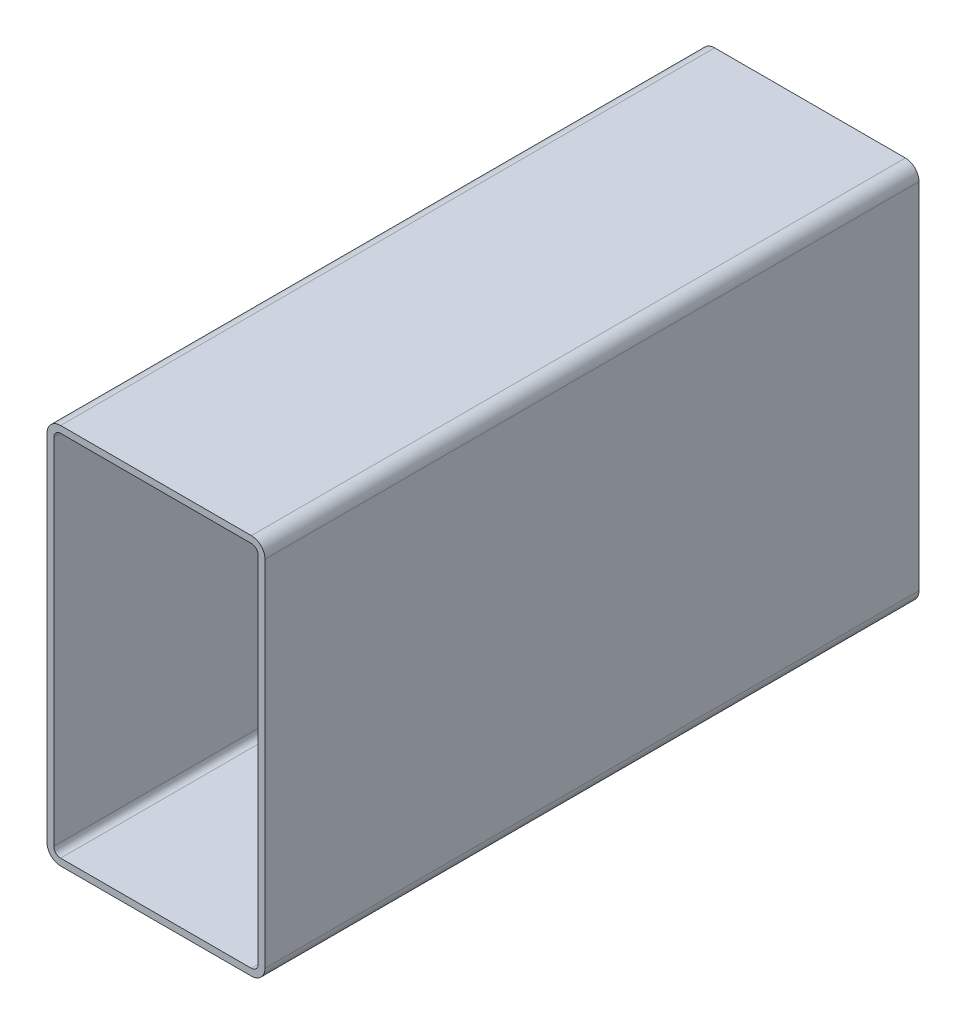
ISO-10303-21;
HEADER;
FILE_DESCRIPTION(('STEP AP214'),'2;1');
FILE_NAME('part.step','',(''),(''),'','','');
FILE_SCHEMA(('AUTOMOTIVE_DESIGN { 1 0 10303 214 1 1 1 1 }'));
ENDSEC;
DATA;
#1=APPLICATION_CONTEXT('core data for automotive mechanical design processes');
#2=APPLICATION_PROTOCOL_DEFINITION('international standard','automotive_design',2000,#1);
#3=PRODUCT_CONTEXT('',#1,'mechanical');
#4=PRODUCT('Part','Part','',(#3));
#5=PRODUCT_RELATED_PRODUCT_CATEGORY('part','',(#4));
#6=PRODUCT_DEFINITION_FORMATION('','',#4);
#7=PRODUCT_DEFINITION_CONTEXT('part definition',#1,'design');
#8=PRODUCT_DEFINITION('design','',#6,#7);
#9=PRODUCT_DEFINITION_SHAPE('','',#8);
#10=(LENGTH_UNIT() NAMED_UNIT(*) SI_UNIT(.MILLI.,.METRE.));
#11=(NAMED_UNIT(*) PLANE_ANGLE_UNIT() SI_UNIT($,.RADIAN.));
#12=(NAMED_UNIT(*) SI_UNIT($,.STERADIAN.) SOLID_ANGLE_UNIT());
#13=UNCERTAINTY_MEASURE_WITH_UNIT(LENGTH_MEASURE(1.E-05),#10,'distance_accuracy_value','');
#14=(GEOMETRIC_REPRESENTATION_CONTEXT(3) GLOBAL_UNCERTAINTY_ASSIGNED_CONTEXT((#13)) GLOBAL_UNIT_ASSIGNED_CONTEXT((#10,
#11,#12)) REPRESENTATION_CONTEXT('',''));
#15=CARTESIAN_POINT('',(0.,0.,0.));
#16=DIRECTION('',(0.,0.,1.));
#17=DIRECTION('',(1.,0.,0.));
#18=AXIS2_PLACEMENT_3D('',#15,#16,#17);
#19=CARTESIAN_POINT('',(8.02517782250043,173.439039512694,304.8));
#20=DIRECTION('',(0.,0.,1.));
#21=DIRECTION('',(1.,0.,0.));
#22=AXIS2_PLACEMENT_3D('',#19,#20,#21);
#23=PLANE('',#22);
#24=CARTESIAN_POINT('',(8.02517782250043,173.439039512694,304.8));
#25=DIRECTION('',(0.,0.,1.));
#26=DIRECTION('',(1.,0.,0.));
#27=AXIS2_PLACEMENT_3D('',#24,#25,#26);
#28=CIRCLE('',#27,6.35);
#29=CARTESIAN_POINT('',(8.02517782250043,179.789039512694,304.8));
#30=VERTEX_POINT('',#29);
#31=CARTESIAN_POINT('',(1.67517782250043,173.439039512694,304.8));
#32=VERTEX_POINT('',#31);
#33=EDGE_CURVE('E211',#30,#32,#28,.T.);
#34=ORIENTED_EDGE('',*,*,#33,.T.);
#35=DIRECTION('',(0.,-1.,0.));
#36=VECTOR('',#35,1.);
#37=CARTESIAN_POINT('',(1.67517782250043,8.33903951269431,304.8));
#38=LINE('',#37,#36);
#39=CARTESIAN_POINT('',(1.67517782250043,8.33903951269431,304.8));
#40=VERTEX_POINT('',#39);
#41=EDGE_CURVE('E214',#32,#40,#38,.T.);
#42=ORIENTED_EDGE('',*,*,#41,.T.);
#43=CARTESIAN_POINT('',(8.02517782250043,8.33903951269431,304.8));
#44=DIRECTION('',(0.,0.,1.));
#45=DIRECTION('',(1.,0.,0.));
#46=AXIS2_PLACEMENT_3D('',#43,#44,#45);
#47=CIRCLE('',#46,6.35);
#48=CARTESIAN_POINT('',(8.02517782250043,1.98903951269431,304.8));
#49=VERTEX_POINT('',#48);
#50=EDGE_CURVE('E217',#40,#49,#47,.T.);
#51=ORIENTED_EDGE('',*,*,#50,.T.);
#52=DIRECTION('',(1.,0.,0.));
#53=VECTOR('',#52,1.);
#54=CARTESIAN_POINT('',(96.9251778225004,1.98903951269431,304.8));
#55=LINE('',#54,#53);
#56=CARTESIAN_POINT('',(96.9251778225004,1.98903951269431,304.8));
#57=VERTEX_POINT('',#56);
#58=EDGE_CURVE('E219',#49,#57,#55,.T.);
#59=ORIENTED_EDGE('',*,*,#58,.T.);
#60=CARTESIAN_POINT('',(96.9251778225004,8.33903951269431,304.8));
#61=DIRECTION('',(0.,0.,1.));
#62=DIRECTION('',(1.,0.,0.));
#63=AXIS2_PLACEMENT_3D('',#60,#61,#62);
#64=CIRCLE('',#63,6.35);
#65=CARTESIAN_POINT('',(103.2751778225,8.33903951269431,304.8));
#66=VERTEX_POINT('',#65);
#67=EDGE_CURVE('E221',#57,#66,#64,.T.);
#68=ORIENTED_EDGE('',*,*,#67,.T.);
#69=DIRECTION('',(0.,1.,0.));
#70=VECTOR('',#69,1.);
#71=CARTESIAN_POINT('',(103.2751778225,173.439039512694,304.8));
#72=LINE('',#71,#70);
#73=CARTESIAN_POINT('',(103.2751778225,173.439039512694,304.8));
#74=VERTEX_POINT('',#73);
#75=EDGE_CURVE('E223',#66,#74,#72,.T.);
#76=ORIENTED_EDGE('',*,*,#75,.T.);
#77=CARTESIAN_POINT('',(96.9251778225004,173.439039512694,304.8));
#78=DIRECTION('',(0.,0.,1.));
#79=DIRECTION('',(1.,0.,0.));
#80=AXIS2_PLACEMENT_3D('',#77,#78,#79);
#81=CIRCLE('',#80,6.34999999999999);
#82=CARTESIAN_POINT('',(96.9251778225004,179.789039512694,304.8));
#83=VERTEX_POINT('',#82);
#84=EDGE_CURVE('E225',#74,#83,#81,.T.);
#85=ORIENTED_EDGE('',*,*,#84,.T.);
#86=DIRECTION('',(-1.,0.,0.));
#87=VECTOR('',#86,1.);
#88=CARTESIAN_POINT('',(8.02517782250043,179.789039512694,304.8));
#89=LINE('',#88,#87);
#90=EDGE_CURVE('E227',#83,#30,#89,.T.);
#91=ORIENTED_EDGE('',*,*,#90,.T.);
#92=EDGE_LOOP('',(#34,#42,#51,#59,#68,#76,#85,#91));
#93=FACE_BOUND('',#92,.T.);
#94=DIRECTION('',(0.,-1.,0.));
#95=VECTOR('',#94,1.);
#96=CARTESIAN_POINT('',(4.85017782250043,8.33903951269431,304.8));
#97=LINE('',#96,#95);
#98=CARTESIAN_POINT('',(4.85017782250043,173.439039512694,304.8));
#99=VERTEX_POINT('',#98);
#100=CARTESIAN_POINT('',(4.85017782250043,8.33903951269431,304.8));
#101=VERTEX_POINT('',#100);
#102=EDGE_CURVE('E154',#99,#101,#97,.T.);
#103=ORIENTED_EDGE('',*,*,#102,.F.);
#104=CARTESIAN_POINT('',(8.02517782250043,173.439039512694,304.8));
#105=DIRECTION('',(0.,0.,1.));
#106=DIRECTION('',(1.,0.,0.));
#107=AXIS2_PLACEMENT_3D('',#104,#105,#106);
#108=CIRCLE('',#107,3.17500000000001);
#109=CARTESIAN_POINT('',(8.02517782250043,176.614039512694,304.8));
#110=VERTEX_POINT('',#109);
#111=EDGE_CURVE('E146',#110,#99,#108,.T.);
#112=ORIENTED_EDGE('',*,*,#111,.F.);
#113=DIRECTION('',(-1.,0.,0.));
#114=VECTOR('',#113,1.);
#115=CARTESIAN_POINT('',(8.02517782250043,176.614039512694,304.8));
#116=LINE('',#115,#114);
#117=CARTESIAN_POINT('',(96.9251778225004,176.614039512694,304.8));
#118=VERTEX_POINT('',#117);
#119=EDGE_CURVE('E179',#118,#110,#116,.T.);
#120=ORIENTED_EDGE('',*,*,#119,.F.);
#121=CARTESIAN_POINT('',(96.9251778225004,173.439039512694,304.8));
#122=DIRECTION('',(0.,0.,1.));
#123=DIRECTION('',(1.,0.,0.));
#124=AXIS2_PLACEMENT_3D('',#121,#122,#123);
#125=CIRCLE('',#124,3.175);
#126=CARTESIAN_POINT('',(100.1001778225,173.439039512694,304.8));
#127=VERTEX_POINT('',#126);
#128=EDGE_CURVE('E177',#127,#118,#125,.T.);
#129=ORIENTED_EDGE('',*,*,#128,.F.);
#130=DIRECTION('',(0.,1.,0.));
#131=VECTOR('',#130,1.);
#132=CARTESIAN_POINT('',(100.1001778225,173.439039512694,304.8));
#133=LINE('',#132,#131);
#134=CARTESIAN_POINT('',(100.1001778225,8.33903951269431,304.8));
#135=VERTEX_POINT('',#134);
#136=EDGE_CURVE('E175',#135,#127,#133,.T.);
#137=ORIENTED_EDGE('',*,*,#136,.F.);
#138=CARTESIAN_POINT('',(96.9251778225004,8.33903951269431,304.8));
#139=DIRECTION('',(0.,0.,1.));
#140=DIRECTION('',(1.,0.,0.));
#141=AXIS2_PLACEMENT_3D('',#138,#139,#140);
#142=CIRCLE('',#141,3.175);
#143=CARTESIAN_POINT('',(96.9251778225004,5.16403951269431,304.8));
#144=VERTEX_POINT('',#143);
#145=EDGE_CURVE('E173',#144,#135,#142,.T.);
#146=ORIENTED_EDGE('',*,*,#145,.F.);
#147=DIRECTION('',(1.,0.,0.));
#148=VECTOR('',#147,1.);
#149=CARTESIAN_POINT('',(96.9251778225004,5.16403951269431,304.8));
#150=LINE('',#149,#148);
#151=CARTESIAN_POINT('',(8.02517782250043,5.16403951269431,304.8));
#152=VERTEX_POINT('',#151);
#153=EDGE_CURVE('E169',#152,#144,#150,.T.);
#154=ORIENTED_EDGE('',*,*,#153,.F.);
#155=CARTESIAN_POINT('',(8.02517782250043,8.33903951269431,304.8));
#156=DIRECTION('',(0.,0.,1.));
#157=DIRECTION('',(1.,0.,0.));
#158=AXIS2_PLACEMENT_3D('',#155,#156,#157);
#159=CIRCLE('',#158,3.175);
#160=EDGE_CURVE('E167',#101,#152,#159,.T.);
#161=ORIENTED_EDGE('',*,*,#160,.F.);
#162=EDGE_LOOP('',(#103,#112,#120,#129,#137,#146,#154,#161));
#163=FACE_BOUND('',#162,.T.);
#164=ADVANCED_FACE('F33',(#93,#163),#23,.T.);
#165=CARTESIAN_POINT('',(8.02517782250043,173.439039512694,0.));
#166=DIRECTION('',(0.,0.,1.));
#167=DIRECTION('',(1.,0.,0.));
#168=AXIS2_PLACEMENT_3D('',#165,#166,#167);
#169=PLANE('',#168);
#170=CARTESIAN_POINT('',(8.02517782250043,173.439039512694,0.));
#171=DIRECTION('',(0.,0.,1.));
#172=DIRECTION('',(1.,0.,0.));
#173=AXIS2_PLACEMENT_3D('',#170,#171,#172);
#174=CIRCLE('',#173,6.35);
#175=CARTESIAN_POINT('',(8.02517782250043,179.789039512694,0.));
#176=VERTEX_POINT('',#175);
#177=CARTESIAN_POINT('',(1.67517782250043,173.439039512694,0.));
#178=VERTEX_POINT('',#177);
#179=EDGE_CURVE('E162',#176,#178,#174,.T.);
#180=ORIENTED_EDGE('',*,*,#179,.F.);
#181=DIRECTION('',(-1.,0.,0.));
#182=VECTOR('',#181,1.);
#183=CARTESIAN_POINT('',(8.02517782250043,179.789039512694,0.));
#184=LINE('',#183,#182);
#185=CARTESIAN_POINT('',(96.9251778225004,179.789039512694,0.));
#186=VERTEX_POINT('',#185);
#187=EDGE_CURVE('E215',#186,#176,#184,.T.);
#188=ORIENTED_EDGE('',*,*,#187,.F.);
#189=CARTESIAN_POINT('',(96.9251778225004,173.439039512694,0.));
#190=DIRECTION('',(0.,0.,1.));
#191=DIRECTION('',(1.,0.,0.));
#192=AXIS2_PLACEMENT_3D('',#189,#190,#191);
#193=CIRCLE('',#192,6.34999999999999);
#194=CARTESIAN_POINT('',(103.2751778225,173.439039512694,0.));
#195=VERTEX_POINT('',#194);
#196=EDGE_CURVE('E242',#195,#186,#193,.T.);
#197=ORIENTED_EDGE('',*,*,#196,.F.);
#198=DIRECTION('',(0.,1.,0.));
#199=VECTOR('',#198,1.);
#200=CARTESIAN_POINT('',(103.2751778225,173.439039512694,0.));
#201=LINE('',#200,#199);
#202=CARTESIAN_POINT('',(103.2751778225,8.33903951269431,0.));
#203=VERTEX_POINT('',#202);
#204=EDGE_CURVE('E240',#203,#195,#201,.T.);
#205=ORIENTED_EDGE('',*,*,#204,.F.);
#206=CARTESIAN_POINT('',(96.9251778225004,8.33903951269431,0.));
#207=DIRECTION('',(0.,0.,1.));
#208=DIRECTION('',(1.,0.,0.));
#209=AXIS2_PLACEMENT_3D('',#206,#207,#208);
#210=CIRCLE('',#209,6.35);
#211=CARTESIAN_POINT('',(96.9251778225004,1.98903951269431,0.));
#212=VERTEX_POINT('',#211);
#213=EDGE_CURVE('E238',#212,#203,#210,.T.);
#214=ORIENTED_EDGE('',*,*,#213,.F.);
#215=DIRECTION('',(1.,0.,0.));
#216=VECTOR('',#215,1.);
#217=CARTESIAN_POINT('',(96.9251778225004,1.98903951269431,0.));
#218=LINE('',#217,#216);
#219=CARTESIAN_POINT('',(8.02517782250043,1.98903951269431,0.));
#220=VERTEX_POINT('',#219);
#221=EDGE_CURVE('E236',#220,#212,#218,.T.);
#222=ORIENTED_EDGE('',*,*,#221,.F.);
#223=CARTESIAN_POINT('',(8.02517782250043,8.33903951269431,0.));
#224=DIRECTION('',(0.,0.,1.));
#225=DIRECTION('',(1.,0.,0.));
#226=AXIS2_PLACEMENT_3D('',#223,#224,#225);
#227=CIRCLE('',#226,6.35);
#228=CARTESIAN_POINT('',(1.67517782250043,8.33903951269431,0.));
#229=VERTEX_POINT('',#228);
#230=EDGE_CURVE('E234',#229,#220,#227,.T.);
#231=ORIENTED_EDGE('',*,*,#230,.F.);
#232=DIRECTION('',(0.,-1.,0.));
#233=VECTOR('',#232,1.);
#234=CARTESIAN_POINT('',(1.67517782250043,8.33903951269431,0.));
#235=LINE('',#234,#233);
#236=EDGE_CURVE('E232',#178,#229,#235,.T.);
#237=ORIENTED_EDGE('',*,*,#236,.F.);
#238=EDGE_LOOP('',(#180,#188,#197,#205,#214,#222,#231,#237));
#239=FACE_BOUND('',#238,.T.);
#240=CARTESIAN_POINT('',(8.02517782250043,173.439039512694,0.));
#241=DIRECTION('',(0.,0.,1.));
#242=DIRECTION('',(1.,0.,0.));
#243=AXIS2_PLACEMENT_3D('',#240,#241,#242);
#244=CIRCLE('',#243,3.17500000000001);
#245=CARTESIAN_POINT('',(8.02517782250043,176.614039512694,0.));
#246=VERTEX_POINT('',#245);
#247=CARTESIAN_POINT('',(4.85017782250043,173.439039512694,0.));
#248=VERTEX_POINT('',#247);
#249=EDGE_CURVE('E56',#246,#248,#244,.T.);
#250=ORIENTED_EDGE('',*,*,#249,.T.);
#251=DIRECTION('',(0.,-1.,0.));
#252=VECTOR('',#251,1.);
#253=CARTESIAN_POINT('',(4.85017782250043,8.33903951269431,0.));
#254=LINE('',#253,#252);
#255=CARTESIAN_POINT('',(4.85017782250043,8.33903951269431,0.));
#256=VERTEX_POINT('',#255);
#257=EDGE_CURVE('E161',#248,#256,#254,.T.);
#258=ORIENTED_EDGE('',*,*,#257,.T.);
#259=CARTESIAN_POINT('',(8.02517782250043,8.33903951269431,0.));
#260=DIRECTION('',(0.,0.,1.));
#261=DIRECTION('',(1.,0.,0.));
#262=AXIS2_PLACEMENT_3D('',#259,#260,#261);
#263=CIRCLE('',#262,3.175);
#264=CARTESIAN_POINT('',(8.02517782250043,5.16403951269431,0.));
#265=VERTEX_POINT('',#264);
#266=EDGE_CURVE('E183',#256,#265,#263,.T.);
#267=ORIENTED_EDGE('',*,*,#266,.T.);
#268=DIRECTION('',(1.,0.,0.));
#269=VECTOR('',#268,1.);
#270=CARTESIAN_POINT('',(96.9251778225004,5.16403951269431,0.));
#271=LINE('',#270,#269);
#272=CARTESIAN_POINT('',(96.9251778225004,5.16403951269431,0.));
#273=VERTEX_POINT('',#272);
#274=EDGE_CURVE('E186',#265,#273,#271,.T.);
#275=ORIENTED_EDGE('',*,*,#274,.T.);
#276=CARTESIAN_POINT('',(96.9251778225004,8.33903951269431,0.));
#277=DIRECTION('',(0.,0.,1.));
#278=DIRECTION('',(1.,0.,0.));
#279=AXIS2_PLACEMENT_3D('',#276,#277,#278);
#280=CIRCLE('',#279,3.175);
#281=CARTESIAN_POINT('',(100.1001778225,8.33903951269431,0.));
#282=VERTEX_POINT('',#281);
#283=EDGE_CURVE('E189',#273,#282,#280,.T.);
#284=ORIENTED_EDGE('',*,*,#283,.T.);
#285=DIRECTION('',(0.,1.,0.));
#286=VECTOR('',#285,1.);
#287=CARTESIAN_POINT('',(100.1001778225,173.439039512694,0.));
#288=LINE('',#287,#286);
#289=CARTESIAN_POINT('',(100.1001778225,173.439039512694,0.));
#290=VERTEX_POINT('',#289);
#291=EDGE_CURVE('E192',#282,#290,#288,.T.);
#292=ORIENTED_EDGE('',*,*,#291,.T.);
#293=CARTESIAN_POINT('',(96.9251778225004,173.439039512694,0.));
#294=DIRECTION('',(0.,0.,1.));
#295=DIRECTION('',(1.,0.,0.));
#296=AXIS2_PLACEMENT_3D('',#293,#294,#295);
#297=CIRCLE('',#296,3.175);
#298=CARTESIAN_POINT('',(96.9251778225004,176.614039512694,0.));
#299=VERTEX_POINT('',#298);
#300=EDGE_CURVE('E195',#290,#299,#297,.T.);
#301=ORIENTED_EDGE('',*,*,#300,.T.);
#302=DIRECTION('',(-1.,0.,0.));
#303=VECTOR('',#302,1.);
#304=CARTESIAN_POINT('',(8.02517782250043,176.614039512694,0.));
#305=LINE('',#304,#303);
#306=EDGE_CURVE('E155',#299,#246,#305,.T.);
#307=ORIENTED_EDGE('',*,*,#306,.T.);
#308=EDGE_LOOP('',(#250,#258,#267,#275,#284,#292,#301,#307));
#309=FACE_BOUND('',#308,.T.);
#310=ADVANCED_FACE('F272',(#239,#309),#169,.F.);
#311=CARTESIAN_POINT('',(8.02517782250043,173.439039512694,304.8));
#312=DIRECTION('',(0.,0.,-1.));
#313=DIRECTION('',(-1.,0.,0.));
#314=AXIS2_PLACEMENT_3D('',#311,#312,#313);
#315=CYLINDRICAL_SURFACE('',#314,6.35);
#316=ORIENTED_EDGE('',*,*,#179,.T.);
#317=DIRECTION('',(0.,0.,-1.));
#318=VECTOR('',#317,1.);
#319=CARTESIAN_POINT('',(1.67517782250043,173.439039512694,304.8));
#320=LINE('',#319,#318);
#321=EDGE_CURVE('E11',#32,#178,#320,.T.);
#322=ORIENTED_EDGE('',*,*,#321,.F.);
#323=ORIENTED_EDGE('',*,*,#33,.F.);
#324=DIRECTION('',(0.,0.,-1.));
#325=VECTOR('',#324,1.);
#326=CARTESIAN_POINT('',(8.02517782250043,179.789039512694,304.8));
#327=LINE('',#326,#325);
#328=EDGE_CURVE('E229',#30,#176,#327,.T.);
#329=ORIENTED_EDGE('',*,*,#328,.T.);
#330=EDGE_LOOP('',(#316,#322,#323,#329));
#331=FACE_BOUND('',#330,.T.);
#332=ADVANCED_FACE('F35',(#331),#315,.T.);
#333=CARTESIAN_POINT('',(1.67517782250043,8.33903951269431,304.8));
#334=DIRECTION('',(1.,0.,0.));
#335=DIRECTION('',(0.,0.,-1.));
#336=AXIS2_PLACEMENT_3D('',#333,#334,#335);
#337=PLANE('',#336);
#338=ORIENTED_EDGE('',*,*,#236,.T.);
#339=DIRECTION('',(0.,0.,-1.));
#340=VECTOR('',#339,1.);
#341=CARTESIAN_POINT('',(1.67517782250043,8.33903951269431,304.8));
#342=LINE('',#341,#340);
#343=EDGE_CURVE('E41',#40,#229,#342,.T.);
#344=ORIENTED_EDGE('',*,*,#343,.F.);
#345=ORIENTED_EDGE('',*,*,#41,.F.);
#346=ORIENTED_EDGE('',*,*,#321,.T.);
#347=EDGE_LOOP('',(#338,#344,#345,#346));
#348=FACE_BOUND('',#347,.T.);
#349=ADVANCED_FACE('F289',(#348),#337,.F.);
#350=CARTESIAN_POINT('',(8.02517782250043,8.33903951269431,304.8));
#351=DIRECTION('',(0.,0.,-1.));
#352=DIRECTION('',(-1.,0.,0.));
#353=AXIS2_PLACEMENT_3D('',#350,#351,#352);
#354=CYLINDRICAL_SURFACE('',#353,6.35);
#355=ORIENTED_EDGE('',*,*,#230,.T.);
#356=DIRECTION('',(0.,0.,-1.));
#357=VECTOR('',#356,1.);
#358=CARTESIAN_POINT('',(8.02517782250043,1.98903951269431,304.8));
#359=LINE('',#358,#357);
#360=EDGE_CURVE('E259',#49,#220,#359,.T.);
#361=ORIENTED_EDGE('',*,*,#360,.F.);
#362=ORIENTED_EDGE('',*,*,#50,.F.);
#363=ORIENTED_EDGE('',*,*,#343,.T.);
#364=EDGE_LOOP('',(#355,#361,#362,#363));
#365=FACE_BOUND('',#364,.T.);
#366=ADVANCED_FACE('F266',(#365),#354,.T.);
#367=CARTESIAN_POINT('',(96.9251778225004,1.98903951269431,304.8));
#368=DIRECTION('',(0.,1.,0.));
#369=DIRECTION('',(0.,0.,1.));
#370=AXIS2_PLACEMENT_3D('',#367,#368,#369);
#371=PLANE('',#370);
#372=ORIENTED_EDGE('',*,*,#221,.T.);
#373=DIRECTION('',(0.,0.,-1.));
#374=VECTOR('',#373,1.);
#375=CARTESIAN_POINT('',(96.9251778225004,1.98903951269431,304.8));
#376=LINE('',#375,#374);
#377=EDGE_CURVE('E256',#57,#212,#376,.T.);
#378=ORIENTED_EDGE('',*,*,#377,.F.);
#379=ORIENTED_EDGE('',*,*,#58,.F.);
#380=ORIENTED_EDGE('',*,*,#360,.T.);
#381=EDGE_LOOP('',(#372,#378,#379,#380));
#382=FACE_BOUND('',#381,.T.);
#383=ADVANCED_FACE('F278',(#382),#371,.F.);
#384=CARTESIAN_POINT('',(96.9251778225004,8.33903951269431,304.8));
#385=DIRECTION('',(0.,0.,-1.));
#386=DIRECTION('',(-1.,0.,0.));
#387=AXIS2_PLACEMENT_3D('',#384,#385,#386);
#388=CYLINDRICAL_SURFACE('',#387,6.35);
#389=ORIENTED_EDGE('',*,*,#213,.T.);
#390=DIRECTION('',(0.,0.,-1.));
#391=VECTOR('',#390,1.);
#392=CARTESIAN_POINT('',(103.2751778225,8.33903951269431,304.8));
#393=LINE('',#392,#391);
#394=EDGE_CURVE('E253',#66,#203,#393,.T.);
#395=ORIENTED_EDGE('',*,*,#394,.F.);
#396=ORIENTED_EDGE('',*,*,#67,.F.);
#397=ORIENTED_EDGE('',*,*,#377,.T.);
#398=EDGE_LOOP('',(#389,#395,#396,#397));
#399=FACE_BOUND('',#398,.T.);
#400=ADVANCED_FACE('F282',(#399),#388,.T.);
#401=CARTESIAN_POINT('',(103.2751778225,173.439039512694,304.8));
#402=DIRECTION('',(-1.,0.,0.));
#403=DIRECTION('',(0.,0.,1.));
#404=AXIS2_PLACEMENT_3D('',#401,#402,#403);
#405=PLANE('',#404);
#406=ORIENTED_EDGE('',*,*,#204,.T.);
#407=DIRECTION('',(0.,0.,-1.));
#408=VECTOR('',#407,1.);
#409=CARTESIAN_POINT('',(103.2751778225,173.439039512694,304.8));
#410=LINE('',#409,#408);
#411=EDGE_CURVE('E250',#74,#195,#410,.T.);
#412=ORIENTED_EDGE('',*,*,#411,.F.);
#413=ORIENTED_EDGE('',*,*,#75,.F.);
#414=ORIENTED_EDGE('',*,*,#394,.T.);
#415=EDGE_LOOP('',(#406,#412,#413,#414));
#416=FACE_BOUND('',#415,.T.);
#417=ADVANCED_FACE('F302',(#416),#405,.F.);
#418=CARTESIAN_POINT('',(96.9251778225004,173.439039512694,304.8));
#419=DIRECTION('',(0.,0.,-1.));
#420=DIRECTION('',(-1.,0.,0.));
#421=AXIS2_PLACEMENT_3D('',#418,#419,#420);
#422=CYLINDRICAL_SURFACE('',#421,6.34999999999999);
#423=ORIENTED_EDGE('',*,*,#196,.T.);
#424=DIRECTION('',(0.,0.,-1.));
#425=VECTOR('',#424,1.);
#426=CARTESIAN_POINT('',(96.9251778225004,179.789039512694,304.8));
#427=LINE('',#426,#425);
#428=EDGE_CURVE('E247',#83,#186,#427,.T.);
#429=ORIENTED_EDGE('',*,*,#428,.F.);
#430=ORIENTED_EDGE('',*,*,#84,.F.);
#431=ORIENTED_EDGE('',*,*,#411,.T.);
#432=EDGE_LOOP('',(#423,#429,#430,#431));
#433=FACE_BOUND('',#432,.T.);
#434=ADVANCED_FACE('F300',(#433),#422,.T.);
#435=CARTESIAN_POINT('',(8.02517782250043,179.789039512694,304.8));
#436=DIRECTION('',(0.,-1.,0.));
#437=DIRECTION('',(0.,0.,-1.));
#438=AXIS2_PLACEMENT_3D('',#435,#436,#437);
#439=PLANE('',#438);
#440=ORIENTED_EDGE('',*,*,#187,.T.);
#441=ORIENTED_EDGE('',*,*,#328,.F.);
#442=ORIENTED_EDGE('',*,*,#90,.F.);
#443=ORIENTED_EDGE('',*,*,#428,.T.);
#444=EDGE_LOOP('',(#440,#441,#442,#443));
#445=FACE_BOUND('',#444,.T.);
#446=ADVANCED_FACE('F295',(#445),#439,.F.);
#447=CARTESIAN_POINT('',(8.02517782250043,173.439039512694,304.8));
#448=DIRECTION('',(0.,0.,-1.));
#449=DIRECTION('',(-1.,0.,0.));
#450=AXIS2_PLACEMENT_3D('',#447,#448,#449);
#451=CYLINDRICAL_SURFACE('',#450,3.17500000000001);
#452=ORIENTED_EDGE('',*,*,#249,.F.);
#453=DIRECTION('',(0.,0.,-1.));
#454=VECTOR('',#453,1.);
#455=CARTESIAN_POINT('',(8.02517782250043,176.614039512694,304.8));
#456=LINE('',#455,#454);
#457=EDGE_CURVE('E150',#110,#246,#456,.T.);
#458=ORIENTED_EDGE('',*,*,#457,.F.);
#459=ORIENTED_EDGE('',*,*,#111,.T.);
#460=DIRECTION('',(0.,0.,-1.));
#461=VECTOR('',#460,1.);
#462=CARTESIAN_POINT('',(4.85017782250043,173.439039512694,304.8));
#463=LINE('',#462,#461);
#464=EDGE_CURVE('E149',#99,#248,#463,.T.);
#465=ORIENTED_EDGE('',*,*,#464,.T.);
#466=EDGE_LOOP('',(#452,#458,#459,#465));
#467=FACE_BOUND('',#466,.T.);
#468=ADVANCED_FACE('F148',(#467),#451,.F.);
#469=CARTESIAN_POINT('',(4.85017782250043,8.33903951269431,304.8));
#470=DIRECTION('',(1.,0.,0.));
#471=DIRECTION('',(0.,0.,-1.));
#472=AXIS2_PLACEMENT_3D('',#469,#470,#471);
#473=PLANE('',#472);
#474=ORIENTED_EDGE('',*,*,#257,.F.);
#475=ORIENTED_EDGE('',*,*,#464,.F.);
#476=ORIENTED_EDGE('',*,*,#102,.T.);
#477=DIRECTION('',(0.,0.,-1.));
#478=VECTOR('',#477,1.);
#479=CARTESIAN_POINT('',(4.85017782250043,8.33903951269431,304.8));
#480=LINE('',#479,#478);
#481=EDGE_CURVE('E163',#101,#256,#480,.T.);
#482=ORIENTED_EDGE('',*,*,#481,.T.);
#483=EDGE_LOOP('',(#474,#475,#476,#482));
#484=FACE_BOUND('',#483,.T.);
#485=ADVANCED_FACE('F158',(#484),#473,.T.);
#486=CARTESIAN_POINT('',(8.02517782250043,8.33903951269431,304.8));
#487=DIRECTION('',(0.,0.,-1.));
#488=DIRECTION('',(-1.,0.,0.));
#489=AXIS2_PLACEMENT_3D('',#486,#487,#488);
#490=CYLINDRICAL_SURFACE('',#489,3.175);
#491=ORIENTED_EDGE('',*,*,#266,.F.);
#492=ORIENTED_EDGE('',*,*,#481,.F.);
#493=ORIENTED_EDGE('',*,*,#160,.T.);
#494=DIRECTION('',(0.,0.,-1.));
#495=VECTOR('',#494,1.);
#496=CARTESIAN_POINT('',(8.02517782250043,5.16403951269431,304.8));
#497=LINE('',#496,#495);
#498=EDGE_CURVE('E208',#152,#265,#497,.T.);
#499=ORIENTED_EDGE('',*,*,#498,.T.);
#500=EDGE_LOOP('',(#491,#492,#493,#499));
#501=FACE_BOUND('',#500,.T.);
#502=ADVANCED_FACE('F327',(#501),#490,.F.);
#503=CARTESIAN_POINT('',(96.9251778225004,5.16403951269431,304.8));
#504=DIRECTION('',(0.,1.,0.));
#505=DIRECTION('',(0.,0.,1.));
#506=AXIS2_PLACEMENT_3D('',#503,#504,#505);
#507=PLANE('',#506);
#508=ORIENTED_EDGE('',*,*,#274,.F.);
#509=ORIENTED_EDGE('',*,*,#498,.F.);
#510=ORIENTED_EDGE('',*,*,#153,.T.);
#511=DIRECTION('',(0.,0.,-1.));
#512=VECTOR('',#511,1.);
#513=CARTESIAN_POINT('',(96.9251778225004,5.16403951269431,304.8));
#514=LINE('',#513,#512);
#515=EDGE_CURVE('E206',#144,#273,#514,.T.);
#516=ORIENTED_EDGE('',*,*,#515,.T.);
#517=EDGE_LOOP('',(#508,#509,#510,#516));
#518=FACE_BOUND('',#517,.T.);
#519=ADVANCED_FACE('F331',(#518),#507,.T.);
#520=CARTESIAN_POINT('',(96.9251778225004,8.33903951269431,304.8));
#521=DIRECTION('',(0.,0.,-1.));
#522=DIRECTION('',(-1.,0.,0.));
#523=AXIS2_PLACEMENT_3D('',#520,#521,#522);
#524=CYLINDRICAL_SURFACE('',#523,3.175);
#525=ORIENTED_EDGE('',*,*,#283,.F.);
#526=ORIENTED_EDGE('',*,*,#515,.F.);
#527=ORIENTED_EDGE('',*,*,#145,.T.);
#528=DIRECTION('',(0.,0.,-1.));
#529=VECTOR('',#528,1.);
#530=CARTESIAN_POINT('',(100.1001778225,8.33903951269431,304.8));
#531=LINE('',#530,#529);
#532=EDGE_CURVE('E204',#135,#282,#531,.T.);
#533=ORIENTED_EDGE('',*,*,#532,.T.);
#534=EDGE_LOOP('',(#525,#526,#527,#533));
#535=FACE_BOUND('',#534,.T.);
#536=ADVANCED_FACE('F337',(#535),#524,.F.);
#537=CARTESIAN_POINT('',(100.1001778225,173.439039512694,304.8));
#538=DIRECTION('',(-1.,0.,0.));
#539=DIRECTION('',(0.,0.,1.));
#540=AXIS2_PLACEMENT_3D('',#537,#538,#539);
#541=PLANE('',#540);
#542=ORIENTED_EDGE('',*,*,#291,.F.);
#543=ORIENTED_EDGE('',*,*,#532,.F.);
#544=ORIENTED_EDGE('',*,*,#136,.T.);
#545=DIRECTION('',(0.,0.,-1.));
#546=VECTOR('',#545,1.);
#547=CARTESIAN_POINT('',(100.1001778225,173.439039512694,304.8));
#548=LINE('',#547,#546);
#549=EDGE_CURVE('E202',#127,#290,#548,.T.);
#550=ORIENTED_EDGE('',*,*,#549,.T.);
#551=EDGE_LOOP('',(#542,#543,#544,#550));
#552=FACE_BOUND('',#551,.T.);
#553=ADVANCED_FACE('F341',(#552),#541,.T.);
#554=CARTESIAN_POINT('',(96.9251778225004,173.439039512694,304.8));
#555=DIRECTION('',(0.,0.,-1.));
#556=DIRECTION('',(-1.,0.,0.));
#557=AXIS2_PLACEMENT_3D('',#554,#555,#556);
#558=CYLINDRICAL_SURFACE('',#557,3.175);
#559=ORIENTED_EDGE('',*,*,#300,.F.);
#560=ORIENTED_EDGE('',*,*,#549,.F.);
#561=ORIENTED_EDGE('',*,*,#128,.T.);
#562=DIRECTION('',(0.,0.,-1.));
#563=VECTOR('',#562,1.);
#564=CARTESIAN_POINT('',(96.9251778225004,176.614039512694,304.8));
#565=LINE('',#564,#563);
#566=EDGE_CURVE('E48',#118,#299,#565,.T.);
#567=ORIENTED_EDGE('',*,*,#566,.T.);
#568=EDGE_LOOP('',(#559,#560,#561,#567));
#569=FACE_BOUND('',#568,.T.);
#570=ADVANCED_FACE('F345',(#569),#558,.F.);
#571=CARTESIAN_POINT('',(8.02517782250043,176.614039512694,304.8));
#572=DIRECTION('',(0.,-1.,0.));
#573=DIRECTION('',(0.,0.,-1.));
#574=AXIS2_PLACEMENT_3D('',#571,#572,#573);
#575=PLANE('',#574);
#576=ORIENTED_EDGE('',*,*,#306,.F.);
#577=ORIENTED_EDGE('',*,*,#566,.F.);
#578=ORIENTED_EDGE('',*,*,#119,.T.);
#579=ORIENTED_EDGE('',*,*,#457,.T.);
#580=EDGE_LOOP('',(#576,#577,#578,#579));
#581=FACE_BOUND('',#580,.T.);
#582=ADVANCED_FACE('F349',(#581),#575,.T.);
#583=CLOSED_SHELL('',(#164,#310,#332,#349,#366,#383,#400,#417,#434,#446,#468,#485,#502,#519,
#536,#553,#570,#582));
#584=MANIFOLD_SOLID_BREP('B2',#583);
#585=ADVANCED_BREP_SHAPE_REPRESENTATION('',(#18,#584),#14);
#586=SHAPE_DEFINITION_REPRESENTATION(#9,#585);
ENDSEC;
END-ISO-10303-21;
